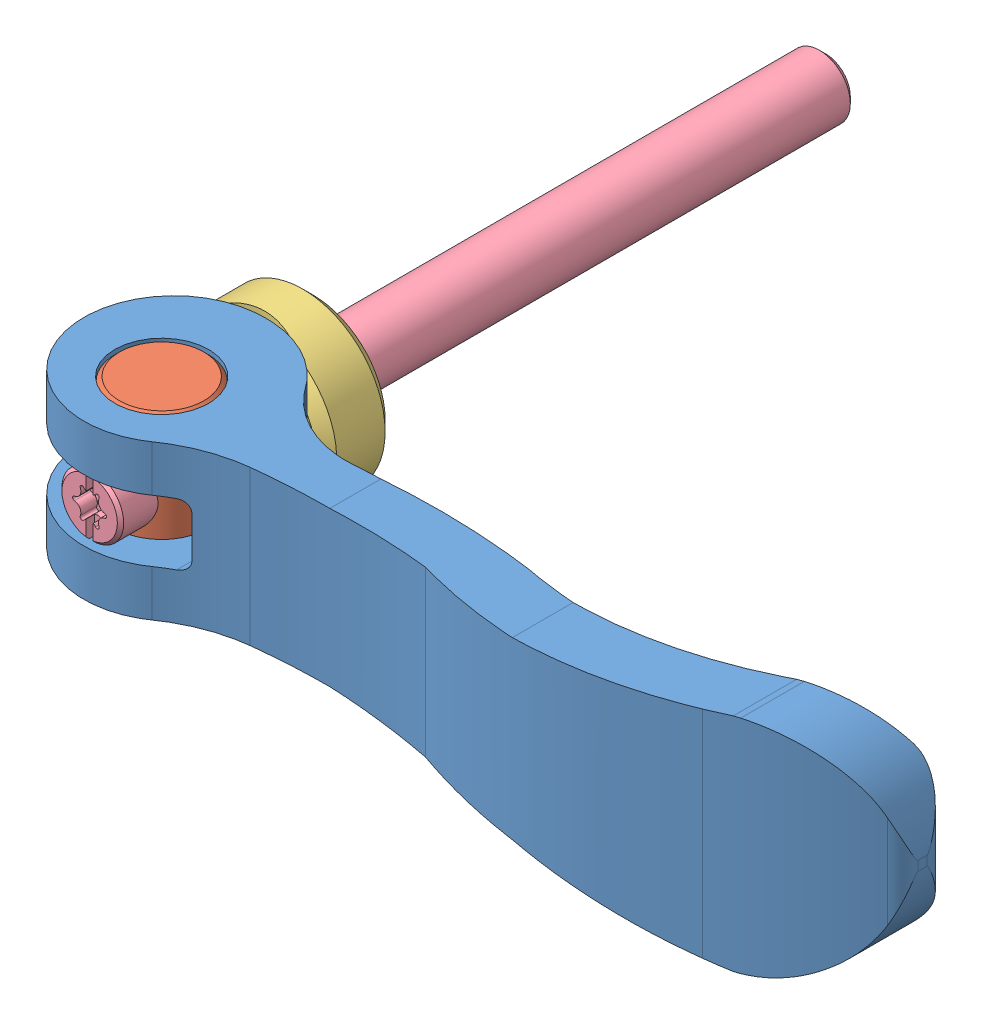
SolidWorks assembly KCL06X50-SUS.SLDASM, configuration Default (file format 15000). Lengths in mm.
Overall size (79.19 21.52 72.07).
4 component instances, 4 part files, 0 mates.
Components (placement in the parent):
- KCL06X50-SUS_01-1: KCL06X50-SUS_01.SLDPRT [ﾃﾞﾌｫﾙﾄ] at (0 0 14.7) x (1 0 0) z (0 -1 0) size (79.19 17.58 21.52)
- KCL06X50-SUS_02-1: KCL06X50-SUS_02.SLDPRT [ﾃﾞﾌｫﾙﾄ] at (0 0 14.7) x (0 1 0) z (1 0 0) size (15 9 9)
- KCL06X50-SUS_03-1: KCL06X50-SUS_03.SLDPRT [ﾃﾞﾌｫﾙﾄ] x (1 0 0) z (0 -1 0) size (16 7.24 16)
- KCL06X50-SUS_04-1: KCL06X50-SUS_04.SLDPRT [ﾃﾞﾌｫﾙﾄ] at (0 0 -19.8) x (0 1 0) z (1 0 0) size (6 71.5 6)
